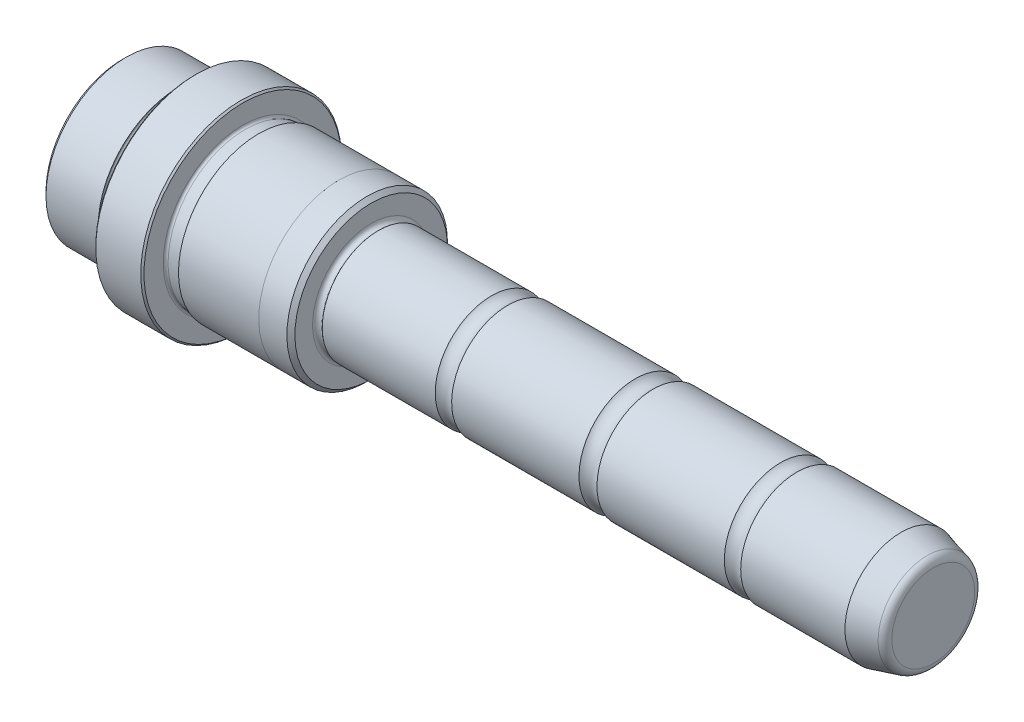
from build123d import *

# Parameters (mm, degrees)
FILLET1_R     = 1
CHAMFER1_SIZE = 0.2
CHAMFER2_SIZE = 0.5


with BuildPart() as part:
    # Sketch1 → Revolve1 (revolve)
    with BuildSketch(Plane.XY):
        with BuildLine():
            Line((70, 5.92820323), (66, 7))
            Line((66, 7), (0.9, 7))
            ThreePointArc((0.9, 7), (0.341886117, 6.825658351), (0, 7.3))
            Line((0, 7.3), (0, 10))
            Line((0, 10), (-4, 10))
            Line((-4, 10), (-14, 10.0001))
            Line((-14, 10.0001), (-14, 9.9))
            ThreePointArc((-14, 9.9), (-14.087867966, 9.687867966), (-14.3, 9.6))
            Line((-14.3, 9.6), (-15.7, 9.6))
            ThreePointArc((-15.7, 9.6), (-15.912132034, 9.687867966), (-16, 9.9))
            Line((-16, 9.9), (-16, 12.5))
            Line((-16, 12.5), (-22, 12.5))
            Line((-22, 12.5), (-22, 9.9))
            ThreePointArc((-22, 9.9), (-22.087867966, 9.687867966), (-22.3, 9.6))
            Line((-22.3, 9.6), (-23.7, 9.6))
            ThreePointArc((-23.7, 9.6), (-23.912132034, 9.687867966), (-24, 9.9))
            Line((-24, 9.9), (-24, 10))
            Line((-24, 10), (-31, 10))
            Line((-31, 10), (-31, 0))
            Line((-31, 0), (70, 0))
            Line((70, 0), (70, 5.92820323))
        make_face()
    revolve(axis=Axis((70, 0, 0), (-1, 0, 0)))

    # Sketch2 → Groove A (revolve, cut)
    with BuildSketch(Plane.XY):
        with BuildLine():
            Line((50.980196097, 7), (53.019803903, 7))
            ThreePointArc((53.019803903, 7), (52, 6.6), (50.980196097, 7))
        make_face()
    revolve(axis=Axis((70, 0, 0), (1, 0, 0)), mode=Mode.SUBTRACT)

    # Sketch3 → Groove B (revolve, cut)
    with BuildSketch(Plane.XY, mode=Mode.PRIVATE) as groove_b_sk:
        with BuildLine():
            Line((32.881966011, 7), (35.118033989, 7))
            ThreePointArc((35.118033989, 7), (34, 6.5), (32.881966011, 7))
        make_face()
    revolve(groove_b_sk.sketch.rotate(Axis((70, 0, 0), (1, 0, 0)), 180), axis=Axis((70, 0, 0), (1, 0, 0)), mode=Mode.SUBTRACT)

    # Sketch4 → Groove C (revolve, cut)
    with BuildSketch(Plane.XY, mode=Mode.PRIVATE) as groove_c_sk:
        with BuildLine():
            Line((14.980196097, 7), (17.019803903, 7))
            ThreePointArc((17.019803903, 7), (16, 6.6), (14.980196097, 7))
        make_face()
    revolve(groove_c_sk.sketch.rotate(Axis((70, 0, 0), (1, 0, 0)), 180), axis=Axis((70, 0, 0), (1, 0, 0)), mode=Mode.SUBTRACT)

    # Fillet1
    fillet1_edges = [part.edges().sort_by_distance(p)[0] for p in [
        (70, -5.92820323, 0),
    ]]
    fillet(fillet1_edges, radius=FILLET1_R)

    # Chamfer1
    chamfer1_edges = [part.edges().sort_by_distance(p)[0] for p in [
        (-16, -12.5, 0),
        (-22, -12.5, 0),
    ]]
    chamfer(chamfer1_edges, length=CHAMFER1_SIZE)

    # Chamfer2
    chamfer2_edges = [part.edges().sort_by_distance(p)[0] for p in [
        (0, -10, 0),
        (-31, -10, 0),
    ]]
    chamfer(chamfer2_edges, length=CHAMFER2_SIZE)


solid = part.part
